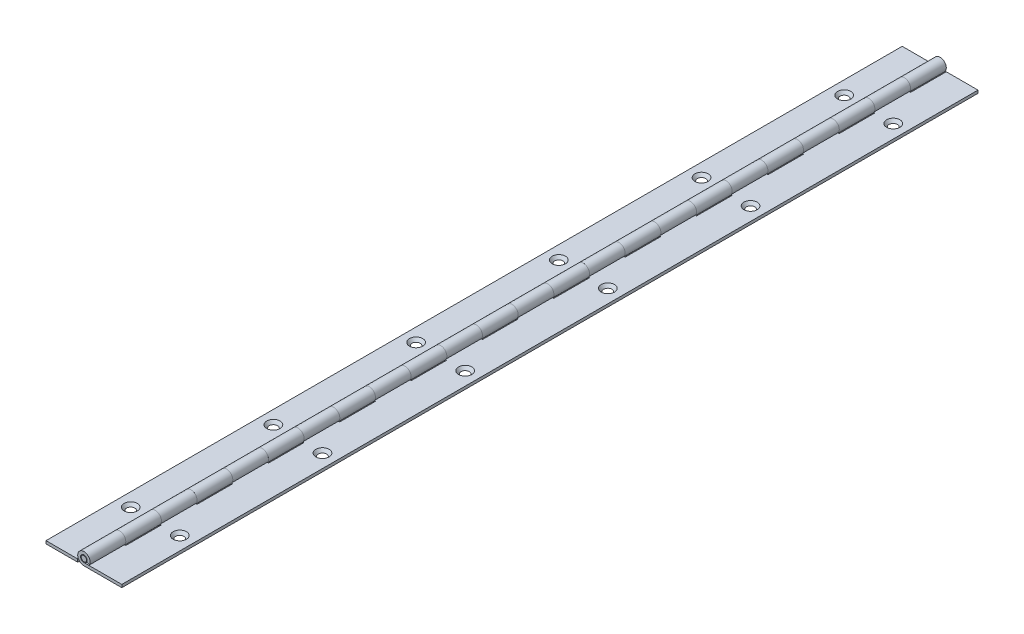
from build123d import *

# Parameters (mm, degrees)
EXTRUDE1_DEPTH            = 152.4
SKETCH3_W                 = 4.41198
SKETCH3_H                 = 12.7
CUT_EXTRUDE1_DEPTH        = 25.4
LPATTERN1_COUNT           = 12
LPATTERN1_PITCH           = 25.4
EXTRUDE2_DEPTH            = 12.7
LPATTERN3_COUNT           = 12
LPATTERN3_PITCH           = 25.4
SKETCH6_W                 = 11.26236
SKETCH6_H                 = 1.016
EXTRUDE5_DEPTH            = 304.8
SKETCH10_R                = 1.4732
CUT_EXTRUDE2_DEPTH        = 154.059814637
CUT_EXTRUDE2_DRAFT        = -41
LPATTERN4_COPY_1_SKETCH_R = 1.4732
LPATTERN4_COPY_1_DEPTH    = 154.059814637
LPATTERN4_COPY_1_DRAFT    = -41
LPATTERN4_COPY_2_SKETCH_R = 1.4732
LPATTERN4_COPY_2_DEPTH    = 154.059814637
LPATTERN4_COPY_2_DRAFT    = -41
LPATTERN4_COPY_3_SKETCH_R = 1.4732
LPATTERN4_COPY_3_DEPTH    = 154.059814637
LPATTERN4_COPY_3_DRAFT    = -41
LPATTERN4_COPY_4_SKETCH_R = 1.4732
LPATTERN4_COPY_4_DEPTH    = 154.059814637
LPATTERN4_COPY_4_DRAFT    = -41
LPATTERN4_COPY_5_SKETCH_R = 1.4732
LPATTERN4_COPY_5_DEPTH    = 154.059814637
LPATTERN4_COPY_5_DRAFT    = -41
MIRROR3_COPY_1_SKETCH_R   = 1.4732
MIRROR3_COPY_1_DEPTH      = 154.059814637
MIRROR3_COPY_1_DRAFT      = -41
MIRROR3_COPY_2_SKETCH_R   = 1.4732
MIRROR3_COPY_2_DEPTH      = 154.059814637
MIRROR3_COPY_2_DRAFT      = -41
MIRROR3_COPY_3_SKETCH_R   = 1.4732
MIRROR3_COPY_3_DEPTH      = 154.059814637
MIRROR3_COPY_3_DRAFT      = -41
MIRROR3_COPY_4_SKETCH_R   = 1.4732
MIRROR3_COPY_4_DEPTH      = 154.059814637
MIRROR3_COPY_4_DRAFT      = -41
MIRROR3_COPY_5_SKETCH_R   = 1.4732
MIRROR3_COPY_5_DEPTH      = 154.059814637
MIRROR3_COPY_5_DRAFT      = -41
MIRROR3_COPY_6_SKETCH_R   = 1.4732
MIRROR3_COPY_6_DEPTH      = 154.059814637
MIRROR3_COPY_6_DRAFT      = -41
SKETCH7_R                 = 1.190625
EXTRUDE4_DEPTH            = 152.4
CHAMFER1_SIZE             = 0.238125


with BuildPart() as part:
    # Sketch2 → Extrude1 (new, symmetric)
    with BuildSketch(Plane.XY):
        with BuildLine():
            Line((13.49375, -1.18999), (13.49375, -2.20599))
            Line((13.49375, -2.20599), (0, -2.20599))
            ThreePointArc((0, -2.20599), (-1.185277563, 1.860513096), (1.999305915, -0.932291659))
            Line((1.999305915, -0.932291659), (1.079072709, -0.503179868))
            ThreePointArc((1.079072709, -0.503179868), (-0.623239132, 1.014475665), (-0.038880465, -1.18999))
            Line((-0.038880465, -1.18999), (13.49375, -1.18999))
        make_face()
    extrude(amount=EXTRUDE1_DEPTH, both=True)

    # Sketch3 → Cut-Extrude1 (cut, symmetric)
    with BuildSketch(Plane(origin=(0, -1.18999, 0), x_dir=(1, 0, 0), z_dir=(0, 1, 0))):
        with Locations((0, 146.05)):
            Rectangle(SKETCH3_W, SKETCH3_H)
    cut_extrude1 = extrude(amount=CUT_EXTRUDE1_DEPTH, both=True, mode=Mode.SUBTRACT)

    # LPattern1: Cut-Extrude1 ×12
    with Locations(*[(0, 0, i * LPATTERN1_PITCH) for i in range(1, LPATTERN1_COUNT)]):
        add(cut_extrude1, mode=Mode.SUBTRACT)


with BuildPart() as body_2:
    # Sketch5 → Extrude2 (new body)
    with BuildSketch(Plane(origin=(0, 0, -152.4), x_dir=(-1, 0, 0), z_dir=(0, 0, -1))):
        with BuildLine():
            Line((0.038880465, -1.18999), (13.49375, -1.18999))
            Line((13.49375, -1.18999), (13.49375, -2.20599))
            Line((13.49375, -2.20599), (0, -2.20599))
            ThreePointArc((0, -2.20599), (-1.185277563, 1.860513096), (1.999305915, -0.932291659))
            Line((1.999305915, -0.932291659), (1.079072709, -0.503179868))
            ThreePointArc((1.079072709, -0.503179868), (-0.656034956, 0.993582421), (0.038880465, -1.18999))
        make_face()
    extrude(amount=-EXTRUDE2_DEPTH)


with BuildPart() as lpattern3_1:
    # LPattern3: pattern copy
    add(body_2.part.moved(Location(Vector(0, 0, 1) * (1 * LPATTERN3_PITCH))))


with BuildPart() as lpattern3_2:
    # LPattern3: pattern copy
    add(body_2.part.moved(Location(Vector(0, 0, 1) * (2 * LPATTERN3_PITCH))))


with BuildPart() as lpattern3_3:
    # LPattern3: pattern copy
    add(body_2.part.moved(Location(Vector(0, 0, 1) * (3 * LPATTERN3_PITCH))))


with BuildPart() as lpattern3_4:
    # LPattern3: pattern copy
    add(body_2.part.moved(Location(Vector(0, 0, 1) * (4 * LPATTERN3_PITCH))))


with BuildPart() as lpattern3_5:
    # LPattern3: pattern copy
    add(body_2.part.moved(Location(Vector(0, 0, 1) * (5 * LPATTERN3_PITCH))))


with BuildPart() as lpattern3_6:
    # LPattern3: pattern copy
    add(body_2.part.moved(Location(Vector(0, 0, 1) * (6 * LPATTERN3_PITCH))))


with BuildPart() as lpattern3_7:
    # LPattern3: pattern copy
    add(body_2.part.moved(Location(Vector(0, 0, 1) * (7 * LPATTERN3_PITCH))))


with BuildPart() as lpattern3_8:
    # LPattern3: pattern copy
    add(body_2.part.moved(Location(Vector(0, 0, 1) * (8 * LPATTERN3_PITCH))))


with BuildPart() as lpattern3_9:
    # LPattern3: pattern copy
    add(body_2.part.moved(Location(Vector(0, 0, 1) * (9 * LPATTERN3_PITCH))))


with BuildPart() as lpattern3_10:
    # LPattern3: pattern copy
    add(body_2.part.moved(Location(Vector(0, 0, 1) * (10 * LPATTERN3_PITCH))))


with BuildPart() as lpattern3_11:
    # LPattern3: pattern copy
    add(body_2.part.moved(Location(Vector(0, 0, 1) * (11 * LPATTERN3_PITCH))))


with BuildPart() as body_2_1:
    add(body_2.part)

    add(lpattern3_1.part)  # Extrude5 merges LPattern3_1

    add(lpattern3_2.part)  # Extrude5 merges LPattern3_2

    add(lpattern3_3.part)  # Extrude5 merges LPattern3_3

    add(lpattern3_4.part)  # Extrude5 merges LPattern3_4

    add(lpattern3_5.part)  # Extrude5 merges LPattern3_5

    add(lpattern3_6.part)  # Extrude5 merges LPattern3_6

    add(lpattern3_7.part)  # Extrude5 merges LPattern3_7

    add(lpattern3_8.part)  # Extrude5 merges LPattern3_8

    add(lpattern3_9.part)  # Extrude5 merges LPattern3_9

    add(lpattern3_10.part)  # Extrude5 merges LPattern3_10

    add(lpattern3_11.part)  # Extrude5 merges LPattern3_11
    # Sketch6 → Extrude5 (add)
    with BuildSketch(Plane(origin=(0, 0, -152.4), x_dir=(-1, 0, 0), z_dir=(0, 0, -1))):
        with Locations((7.86257, -1.69799)):
            Rectangle(SKETCH6_W, SKETCH6_H)
    extrude(amount=-EXTRUDE5_DEPTH)


with BuildPart() as cut_extrude2_tool:
    # Sketch10 → Cut-Extrude2 (with draft: the straight prism first)
    with BuildSketch(Plane(origin=(0, -2.20599, 0), x_dir=(1, 0, 0), z_dir=(0, 1, 0))):
        with Locations((8.73125, 127)):
            Circle(SKETCH10_R)
    extrude(amount=CUT_EXTRUDE2_DEPTH)
    # Cut-Extrude2: the draft: its side faces are tilted about the plane it starts from
    cut_extrude2_sides = [cut_extrude2_tool.faces().sort_by_distance(p)[0] for p in [
        (7.25805, 74.823917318, -127),
    ]]
    draft(cut_extrude2_sides, Plane(origin=(0, -2.20599, 0), x_dir=(1, 0, 0), z_dir=(0, 1, 0)), CUT_EXTRUDE2_DRAFT)


with BuildPart() as part_1:
    add(part.part)

    # Cut-Extrude2: cut by cut_extrude2_tool
    add(cut_extrude2_tool.part, mode=Mode.SUBTRACT)


with BuildPart() as lpattern4_copy_1_tool:
    # LPattern4 copy 1 sketch → LPattern4 copy 1 (with draft: the straight prism first)
    with BuildSketch(Plane(origin=(0, -2.20599, 50.8), x_dir=(1, 0, 0), z_dir=(0, 1, 0))):
        with Locations((8.73125, 127)):
            Circle(LPATTERN4_COPY_1_SKETCH_R)
    extrude(amount=LPATTERN4_COPY_1_DEPTH)
    # LPattern4 copy 1: the draft: its side faces are tilted about the plane it starts from
    lpattern4_copy_1_sides = [lpattern4_copy_1_tool.faces().sort_by_distance(p)[0] for p in [
        (7.25805, 74.823917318, -76.2),
    ]]
    draft(lpattern4_copy_1_sides, Plane(origin=(0, -2.20599, 50.8), x_dir=(1, 0, 0), z_dir=(0, 1, 0)), LPATTERN4_COPY_1_DRAFT)


with BuildPart() as part_2:
    add(part_1.part)

    # LPattern4 copy 1: cut by lpattern4_copy_1_tool
    add(lpattern4_copy_1_tool.part, mode=Mode.SUBTRACT)


with BuildPart() as lpattern4_copy_2_tool:
    # LPattern4 copy 2 sketch → LPattern4 copy 2 (with draft: the straight prism first)
    with BuildSketch(Plane(origin=(0, -2.20599, 101.6), x_dir=(1, 0, 0), z_dir=(0, 1, 0))):
        with Locations((8.73125, 127)):
            Circle(LPATTERN4_COPY_2_SKETCH_R)
    extrude(amount=LPATTERN4_COPY_2_DEPTH)
    # LPattern4 copy 2: the draft: its side faces are tilted about the plane it starts from
    lpattern4_copy_2_sides = [lpattern4_copy_2_tool.faces().sort_by_distance(p)[0] for p in [
        (7.25805, 74.823917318, -25.4),
    ]]
    draft(lpattern4_copy_2_sides, Plane(origin=(0, -2.20599, 101.6), x_dir=(1, 0, 0), z_dir=(0, 1, 0)), LPATTERN4_COPY_2_DRAFT)


with BuildPart() as part_3:
    add(part_2.part)

    # LPattern4 copy 2: cut by lpattern4_copy_2_tool
    add(lpattern4_copy_2_tool.part, mode=Mode.SUBTRACT)


with BuildPart() as lpattern4_copy_3_tool:
    # LPattern4 copy 3 sketch → LPattern4 copy 3 (with draft: the straight prism first)
    with BuildSketch(Plane(origin=(0, -2.20599, 152.4), x_dir=(1, 0, 0), z_dir=(0, 1, 0))):
        with Locations((8.73125, 127)):
            Circle(LPATTERN4_COPY_3_SKETCH_R)
    extrude(amount=LPATTERN4_COPY_3_DEPTH)
    # LPattern4 copy 3: the draft: its side faces are tilted about the plane it starts from
    lpattern4_copy_3_sides = [lpattern4_copy_3_tool.faces().sort_by_distance(p)[0] for p in [
        (7.25805, 74.823917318, 25.4),
    ]]
    draft(lpattern4_copy_3_sides, Plane(origin=(0, -2.20599, 152.4), x_dir=(1, 0, 0), z_dir=(0, 1, 0)), LPATTERN4_COPY_3_DRAFT)


with BuildPart() as part_4:
    add(part_3.part)

    # LPattern4 copy 3: cut by lpattern4_copy_3_tool
    add(lpattern4_copy_3_tool.part, mode=Mode.SUBTRACT)


with BuildPart() as lpattern4_copy_4_tool:
    # LPattern4 copy 4 sketch → LPattern4 copy 4 (with draft: the straight prism first)
    with BuildSketch(Plane(origin=(0, -2.20599, 203.2), x_dir=(1, 0, 0), z_dir=(0, 1, 0))):
        with Locations((8.73125, 127)):
            Circle(LPATTERN4_COPY_4_SKETCH_R)
    extrude(amount=LPATTERN4_COPY_4_DEPTH)
    # LPattern4 copy 4: the draft: its side faces are tilted about the plane it starts from
    lpattern4_copy_4_sides = [lpattern4_copy_4_tool.faces().sort_by_distance(p)[0] for p in [
        (7.25805, 74.823917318, 76.2),
    ]]
    draft(lpattern4_copy_4_sides, Plane(origin=(0, -2.20599, 203.2), x_dir=(1, 0, 0), z_dir=(0, 1, 0)), LPATTERN4_COPY_4_DRAFT)


with BuildPart() as part_5:
    add(part_4.part)

    # LPattern4 copy 4: cut by lpattern4_copy_4_tool
    add(lpattern4_copy_4_tool.part, mode=Mode.SUBTRACT)


with BuildPart() as lpattern4_copy_5_tool:
    # LPattern4 copy 5 sketch → LPattern4 copy 5 (with draft: the straight prism first)
    with BuildSketch(Plane(origin=(0, -2.20599, 254), x_dir=(1, 0, 0), z_dir=(0, 1, 0))):
        with Locations((8.73125, 127)):
            Circle(LPATTERN4_COPY_5_SKETCH_R)
    extrude(amount=LPATTERN4_COPY_5_DEPTH)
    # LPattern4 copy 5: the draft: its side faces are tilted about the plane it starts from
    lpattern4_copy_5_sides = [lpattern4_copy_5_tool.faces().sort_by_distance(p)[0] for p in [
        (7.25805, 74.823917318, 127),
    ]]
    draft(lpattern4_copy_5_sides, Plane(origin=(0, -2.20599, 254), x_dir=(1, 0, 0), z_dir=(0, 1, 0)), LPATTERN4_COPY_5_DRAFT)


with BuildPart() as part_6:
    add(part_5.part)

    # LPattern4 copy 5: cut by lpattern4_copy_5_tool
    add(lpattern4_copy_5_tool.part, mode=Mode.SUBTRACT)


with BuildPart() as mirror3_copy_1_tool:
    # Mirror3 copy 1 sketch → Mirror3 copy 1 (with draft: the straight prism first)
    with BuildSketch(Plane(origin=(0, -2.20599, 0), x_dir=(-1, 0, 0), z_dir=(0, 1, 0))):
        with Locations((8.73125, -127)):
            Circle(MIRROR3_COPY_1_SKETCH_R)
    extrude(amount=MIRROR3_COPY_1_DEPTH)
    # Mirror3 copy 1: the draft: its side faces are tilted about the plane it starts from
    mirror3_copy_1_sides = [mirror3_copy_1_tool.faces().sort_by_distance(p)[0] for p in [
        (-7.25805, 74.823917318, -127),
    ]]
    draft(mirror3_copy_1_sides, Plane(origin=(0, -2.20599, 0), x_dir=(-1, 0, 0), z_dir=(0, 1, 0)), MIRROR3_COPY_1_DRAFT)


with BuildPart() as body_2_2:
    add(body_2_1.part)

    # Mirror3 copy 1: cut by mirror3_copy_1_tool
    add(mirror3_copy_1_tool.part, mode=Mode.SUBTRACT)


with BuildPart() as mirror3_copy_2_tool:
    # Mirror3 copy 2 sketch → Mirror3 copy 2 (with draft: the straight prism first)
    with BuildSketch(Plane(origin=(0, -2.20599, 50.8), x_dir=(-1, 0, 0), z_dir=(0, 1, 0))):
        with Locations((8.73125, -127)):
            Circle(MIRROR3_COPY_2_SKETCH_R)
    extrude(amount=MIRROR3_COPY_2_DEPTH)
    # Mirror3 copy 2: the draft: its side faces are tilted about the plane it starts from
    mirror3_copy_2_sides = [mirror3_copy_2_tool.faces().sort_by_distance(p)[0] for p in [
        (-7.25805, 74.823917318, -76.2),
    ]]
    draft(mirror3_copy_2_sides, Plane(origin=(0, -2.20599, 50.8), x_dir=(-1, 0, 0), z_dir=(0, 1, 0)), MIRROR3_COPY_2_DRAFT)


with BuildPart() as body_2_3:
    add(body_2_2.part)

    # Mirror3 copy 2: cut by mirror3_copy_2_tool
    add(mirror3_copy_2_tool.part, mode=Mode.SUBTRACT)


with BuildPart() as mirror3_copy_3_tool:
    # Mirror3 copy 3 sketch → Mirror3 copy 3 (with draft: the straight prism first)
    with BuildSketch(Plane(origin=(0, -2.20599, 101.6), x_dir=(-1, 0, 0), z_dir=(0, 1, 0))):
        with Locations((8.73125, -127)):
            Circle(MIRROR3_COPY_3_SKETCH_R)
    extrude(amount=MIRROR3_COPY_3_DEPTH)
    # Mirror3 copy 3: the draft: its side faces are tilted about the plane it starts from
    mirror3_copy_3_sides = [mirror3_copy_3_tool.faces().sort_by_distance(p)[0] for p in [
        (-7.25805, 74.823917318, -25.4),
    ]]
    draft(mirror3_copy_3_sides, Plane(origin=(0, -2.20599, 101.6), x_dir=(-1, 0, 0), z_dir=(0, 1, 0)), MIRROR3_COPY_3_DRAFT)


with BuildPart() as body_2_4:
    add(body_2_3.part)

    # Mirror3 copy 3: cut by mirror3_copy_3_tool
    add(mirror3_copy_3_tool.part, mode=Mode.SUBTRACT)


with BuildPart() as mirror3_copy_4_tool:
    # Mirror3 copy 4 sketch → Mirror3 copy 4 (with draft: the straight prism first)
    with BuildSketch(Plane(origin=(0, -2.20599, 152.4), x_dir=(-1, 0, 0), z_dir=(0, 1, 0))):
        with Locations((8.73125, -127)):
            Circle(MIRROR3_COPY_4_SKETCH_R)
    extrude(amount=MIRROR3_COPY_4_DEPTH)
    # Mirror3 copy 4: the draft: its side faces are tilted about the plane it starts from
    mirror3_copy_4_sides = [mirror3_copy_4_tool.faces().sort_by_distance(p)[0] for p in [
        (-7.25805, 74.823917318, 25.4),
    ]]
    draft(mirror3_copy_4_sides, Plane(origin=(0, -2.20599, 152.4), x_dir=(-1, 0, 0), z_dir=(0, 1, 0)), MIRROR3_COPY_4_DRAFT)


with BuildPart() as body_2_5:
    add(body_2_4.part)

    # Mirror3 copy 4: cut by mirror3_copy_4_tool
    add(mirror3_copy_4_tool.part, mode=Mode.SUBTRACT)


with BuildPart() as mirror3_copy_5_tool:
    # Mirror3 copy 5 sketch → Mirror3 copy 5 (with draft: the straight prism first)
    with BuildSketch(Plane(origin=(0, -2.20599, 203.2), x_dir=(-1, 0, 0), z_dir=(0, 1, 0))):
        with Locations((8.73125, -127)):
            Circle(MIRROR3_COPY_5_SKETCH_R)
    extrude(amount=MIRROR3_COPY_5_DEPTH)
    # Mirror3 copy 5: the draft: its side faces are tilted about the plane it starts from
    mirror3_copy_5_sides = [mirror3_copy_5_tool.faces().sort_by_distance(p)[0] for p in [
        (-7.25805, 74.823917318, 76.2),
    ]]
    draft(mirror3_copy_5_sides, Plane(origin=(0, -2.20599, 203.2), x_dir=(-1, 0, 0), z_dir=(0, 1, 0)), MIRROR3_COPY_5_DRAFT)


with BuildPart() as body_2_6:
    add(body_2_5.part)

    # Mirror3 copy 5: cut by mirror3_copy_5_tool
    add(mirror3_copy_5_tool.part, mode=Mode.SUBTRACT)


with BuildPart() as mirror3_copy_6_tool:
    # Mirror3 copy 6 sketch → Mirror3 copy 6 (with draft: the straight prism first)
    with BuildSketch(Plane(origin=(0, -2.20599, 254), x_dir=(-1, 0, 0), z_dir=(0, 1, 0))):
        with Locations((8.73125, -127)):
            Circle(MIRROR3_COPY_6_SKETCH_R)
    extrude(amount=MIRROR3_COPY_6_DEPTH)
    # Mirror3 copy 6: the draft: its side faces are tilted about the plane it starts from
    mirror3_copy_6_sides = [mirror3_copy_6_tool.faces().sort_by_distance(p)[0] for p in [
        (-7.25805, 74.823917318, 127),
    ]]
    draft(mirror3_copy_6_sides, Plane(origin=(0, -2.20599, 254), x_dir=(-1, 0, 0), z_dir=(0, 1, 0)), MIRROR3_COPY_6_DRAFT)


with BuildPart() as body_2_7:
    add(body_2_6.part)

    # Mirror3 copy 6: cut by mirror3_copy_6_tool
    add(mirror3_copy_6_tool.part, mode=Mode.SUBTRACT)


with BuildPart() as body_3:
    # Sketch7 → Extrude4 (new, symmetric)
    with BuildSketch(Plane.XY):
        with Locations(Location((0, 0, 0), (0, 0, 180))):
            Circle(SKETCH7_R)
    extrude(amount=EXTRUDE4_DEPTH, both=True)

    # Chamfer1
    chamfer1_edges = [body_3.edges().sort_by_distance(p)[0] for p in [
        (1.190625, 0, -152.4),
        (1.190625, 0, 152.4),
    ]]
    chamfer(chamfer1_edges, length=CHAMFER1_SIZE)


solid = Compound([part_6.part, body_2_7.part, body_3.part])
